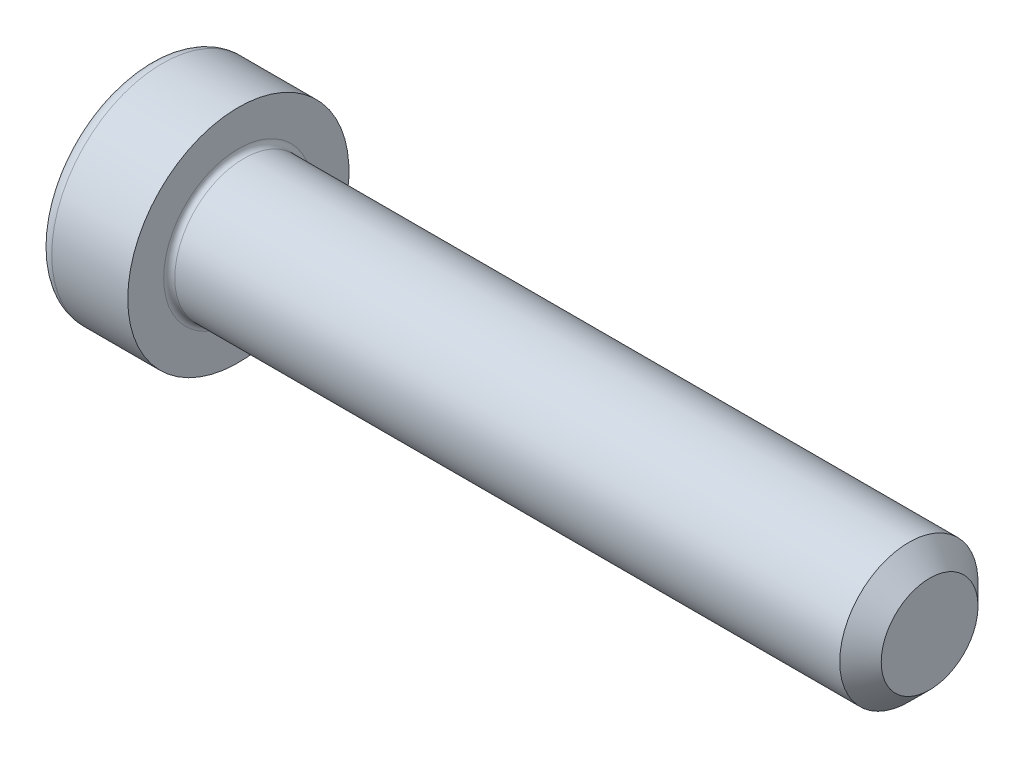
ISO-10303-21;
HEADER;
FILE_DESCRIPTION(('STEP AP214'),'2;1');
FILE_NAME('part.step','',(''),(''),'','','');
FILE_SCHEMA(('AUTOMOTIVE_DESIGN { 1 0 10303 214 1 1 1 1 }'));
ENDSEC;
DATA;
#1=APPLICATION_CONTEXT('core data for automotive mechanical design processes');
#2=APPLICATION_PROTOCOL_DEFINITION('international standard','automotive_design',2000,#1);
#3=PRODUCT_CONTEXT('',#1,'mechanical');
#4=PRODUCT('Part','Part','',(#3));
#5=PRODUCT_RELATED_PRODUCT_CATEGORY('part','',(#4));
#6=PRODUCT_DEFINITION_FORMATION('','',#4);
#7=PRODUCT_DEFINITION_CONTEXT('part definition',#1,'design');
#8=PRODUCT_DEFINITION('design','',#6,#7);
#9=PRODUCT_DEFINITION_SHAPE('','',#8);
#10=(LENGTH_UNIT() NAMED_UNIT(*) SI_UNIT(.MILLI.,.METRE.));
#11=(NAMED_UNIT(*) PLANE_ANGLE_UNIT() SI_UNIT($,.RADIAN.));
#12=(NAMED_UNIT(*) SI_UNIT($,.STERADIAN.) SOLID_ANGLE_UNIT());
#13=UNCERTAINTY_MEASURE_WITH_UNIT(LENGTH_MEASURE(1.E-05),#10,'distance_accuracy_value','');
#14=(GEOMETRIC_REPRESENTATION_CONTEXT(3) GLOBAL_UNCERTAINTY_ASSIGNED_CONTEXT((#13)) GLOBAL_UNIT_ASSIGNED_CONTEXT((#10,
#11,#12)) REPRESENTATION_CONTEXT('',''));
#15=CARTESIAN_POINT('',(0.,0.,0.));
#16=DIRECTION('',(0.,0.,1.));
#17=DIRECTION('',(1.,0.,0.));
#18=AXIS2_PLACEMENT_3D('',#15,#16,#17);
#19=CARTESIAN_POINT('',(-56.5,7.00000000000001,0.));
#20=DIRECTION('',(1.,0.,0.));
#21=DIRECTION('',(0.,0.,-1.));
#22=AXIS2_PLACEMENT_3D('',#19,#20,#21);
#23=PLANE('',#22);
#24=DIRECTION('',(0.,-0.5,-0.866025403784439));
#25=VECTOR('',#24,1.);
#26=CARTESIAN_POINT('',(-56.5,4.61880215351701,0.));
#27=LINE('',#26,#25);
#28=CARTESIAN_POINT('',(-56.5,4.61880215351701,0.));
#29=VERTEX_POINT('',#28);
#30=CARTESIAN_POINT('',(-56.5,2.3094010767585,-4.));
#31=VERTEX_POINT('',#30);
#32=EDGE_CURVE('E373',#29,#31,#27,.T.);
#33=ORIENTED_EDGE('',*,*,#32,.F.);
#34=DIRECTION('',(0.,0.5,-0.866025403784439));
#35=VECTOR('',#34,1.);
#36=CARTESIAN_POINT('',(-56.5,2.30940107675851,4.));
#37=LINE('',#36,#35);
#38=CARTESIAN_POINT('',(-56.5,2.30940107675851,4.));
#39=VERTEX_POINT('',#38);
#40=EDGE_CURVE('E449',#39,#29,#37,.T.);
#41=ORIENTED_EDGE('',*,*,#40,.F.);
#42=DIRECTION('',(0.,1.,0.));
#43=VECTOR('',#42,1.);
#44=CARTESIAN_POINT('',(-56.5,-2.30940107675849,4.));
#45=LINE('',#44,#43);
#46=CARTESIAN_POINT('',(-56.5,-2.30940107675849,4.));
#47=VERTEX_POINT('',#46);
#48=EDGE_CURVE('E720',#47,#39,#45,.T.);
#49=ORIENTED_EDGE('',*,*,#48,.F.);
#50=DIRECTION('',(0.,0.5,0.866025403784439));
#51=VECTOR('',#50,1.);
#52=CARTESIAN_POINT('',(-56.5,-4.618802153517,0.));
#53=LINE('',#52,#51);
#54=CARTESIAN_POINT('',(-56.5,-4.618802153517,0.));
#55=VERTEX_POINT('',#54);
#56=EDGE_CURVE('E716',#55,#47,#53,.T.);
#57=ORIENTED_EDGE('',*,*,#56,.F.);
#58=DIRECTION('',(0.,-0.5,0.866025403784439));
#59=VECTOR('',#58,1.);
#60=CARTESIAN_POINT('',(-56.5,-2.3094010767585,-4.));
#61=LINE('',#60,#59);
#62=CARTESIAN_POINT('',(-56.5,-2.3094010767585,-4.));
#63=VERTEX_POINT('',#62);
#64=EDGE_CURVE('E433',#63,#55,#61,.T.);
#65=ORIENTED_EDGE('',*,*,#64,.F.);
#66=DIRECTION('',(0.,-1.,0.));
#67=VECTOR('',#66,1.);
#68=CARTESIAN_POINT('',(-56.5,2.3094010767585,-4.));
#69=LINE('',#68,#67);
#70=EDGE_CURVE('E430',#31,#63,#69,.T.);
#71=ORIENTED_EDGE('',*,*,#70,.F.);
#72=EDGE_LOOP('',(#33,#41,#49,#57,#65,#71));
#73=FACE_BOUND('',#72,.T.);
#74=CARTESIAN_POINT('',(-56.5,0.,0.));
#75=DIRECTION('',(-1.,0.,0.));
#76=DIRECTION('',(0.,0.,1.));
#77=AXIS2_PLACEMENT_3D('',#74,#75,#76);
#78=CIRCLE('',#77,7.00000000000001);
#79=CARTESIAN_POINT('',(-56.5,0.,7.00000000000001));
#80=VERTEX_POINT('',#79);
#81=EDGE_CURVE('E11',#80,#80,#78,.T.);
#82=ORIENTED_EDGE('',*,*,#81,.T.);
#83=EDGE_LOOP('',(#82));
#84=FACE_BOUND('',#83,.T.);
#85=ADVANCED_FACE('F358',(#73,#84),#23,.F.);
#86=CARTESIAN_POINT('',(-55.5,0.,0.));
#87=DIRECTION('',(-1.,0.,0.));
#88=DIRECTION('',(0.,0.,1.));
#89=AXIS2_PLACEMENT_3D('',#86,#87,#88);
#90=TOROIDAL_SURFACE('',#89,7.00000000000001,1.);
#91=ORIENTED_EDGE('',*,*,#81,.F.);
#92=EDGE_LOOP('',(#91));
#93=FACE_BOUND('',#92,.T.);
#94=CARTESIAN_POINT('',(-55.5,0.,0.));
#95=DIRECTION('',(-1.,0.,0.));
#96=DIRECTION('',(0.,0.,1.));
#97=AXIS2_PLACEMENT_3D('',#94,#95,#96);
#98=CIRCLE('',#97,8.00000000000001);
#99=CARTESIAN_POINT('',(-55.5,0.,8.00000000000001));
#100=VERTEX_POINT('',#99);
#101=EDGE_CURVE('E366',#100,#100,#98,.T.);
#102=ORIENTED_EDGE('',*,*,#101,.T.);
#103=EDGE_LOOP('',(#102));
#104=FACE_BOUND('',#103,.T.);
#105=ADVANCED_FACE('F490',(#93,#104),#90,.T.);
#106=CARTESIAN_POINT('',(-89.316393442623,0.,0.));
#107=DIRECTION('',(-1.,0.,0.));
#108=DIRECTION('',(0.,0.,1.));
#109=AXIS2_PLACEMENT_3D('',#106,#107,#108);
#110=CYLINDRICAL_SURFACE('',#109,8.00000000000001);
#111=ORIENTED_EDGE('',*,*,#101,.F.);
#112=EDGE_LOOP('',(#111));
#113=FACE_BOUND('',#112,.T.);
#114=CARTESIAN_POINT('',(-50.,0.,0.));
#115=DIRECTION('',(-1.,0.,0.));
#116=DIRECTION('',(0.,0.,1.));
#117=AXIS2_PLACEMENT_3D('',#114,#115,#116);
#118=CIRCLE('',#117,8.00000000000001);
#119=CARTESIAN_POINT('',(-50.,0.,8.00000000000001));
#120=VERTEX_POINT('',#119);
#121=EDGE_CURVE('E484',#120,#120,#118,.T.);
#122=ORIENTED_EDGE('',*,*,#121,.T.);
#123=EDGE_LOOP('',(#122));
#124=FACE_BOUND('',#123,.T.);
#125=ADVANCED_FACE('F492',(#113,#124),#110,.T.);
#126=CARTESIAN_POINT('',(-50.,5.4,0.));
#127=DIRECTION('',(-1.,0.,0.));
#128=DIRECTION('',(0.,0.,1.));
#129=AXIS2_PLACEMENT_3D('',#126,#127,#128);
#130=PLANE('',#129);
#131=ORIENTED_EDGE('',*,*,#121,.F.);
#132=EDGE_LOOP('',(#131));
#133=FACE_BOUND('',#132,.T.);
#134=CARTESIAN_POINT('',(-50.,0.,0.));
#135=DIRECTION('',(-1.,0.,0.));
#136=DIRECTION('',(0.,0.,1.));
#137=AXIS2_PLACEMENT_3D('',#134,#135,#136);
#138=CIRCLE('',#137,5.4);
#139=CARTESIAN_POINT('',(-50.,0.,5.4));
#140=VERTEX_POINT('',#139);
#141=EDGE_CURVE('E481',#140,#140,#138,.T.);
#142=ORIENTED_EDGE('',*,*,#141,.T.);
#143=EDGE_LOOP('',(#142));
#144=FACE_BOUND('',#143,.T.);
#145=ADVANCED_FACE('F495',(#133,#144),#130,.F.);
#146=CARTESIAN_POINT('',(-49.6,0.,0.));
#147=DIRECTION('',(-1.,0.,0.));
#148=DIRECTION('',(0.,0.,1.));
#149=AXIS2_PLACEMENT_3D('',#146,#147,#148);
#150=TOROIDAL_SURFACE('',#149,5.4,0.399999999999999);
#151=ORIENTED_EDGE('',*,*,#141,.F.);
#152=EDGE_LOOP('',(#151));
#153=FACE_BOUND('',#152,.T.);
#154=CARTESIAN_POINT('',(-49.6,0.,0.));
#155=DIRECTION('',(-1.,0.,0.));
#156=DIRECTION('',(0.,0.,1.));
#157=AXIS2_PLACEMENT_3D('',#154,#155,#156);
#158=CIRCLE('',#157,5.);
#159=CARTESIAN_POINT('',(-49.6,0.,5.));
#160=VERTEX_POINT('',#159);
#161=EDGE_CURVE('E478',#160,#160,#158,.T.);
#162=ORIENTED_EDGE('',*,*,#161,.T.);
#163=EDGE_LOOP('',(#162));
#164=FACE_BOUND('',#163,.T.);
#165=ADVANCED_FACE('F501',(#153,#164),#150,.F.);
#166=CARTESIAN_POINT('',(-89.316393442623,0.,0.));
#167=DIRECTION('',(-1.,0.,0.));
#168=DIRECTION('',(0.,0.,1.));
#169=AXIS2_PLACEMENT_3D('',#166,#167,#168);
#170=CYLINDRICAL_SURFACE('',#169,5.);
#171=ORIENTED_EDGE('',*,*,#161,.F.);
#172=EDGE_LOOP('',(#171));
#173=FACE_BOUND('',#172,.T.);
#174=CARTESIAN_POINT('',(-1.50000000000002,0.,0.));
#175=DIRECTION('',(-1.,0.,0.));
#176=DIRECTION('',(0.,0.,1.));
#177=AXIS2_PLACEMENT_3D('',#174,#175,#176);
#178=CIRCLE('',#177,5.00000000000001);
#179=CARTESIAN_POINT('',(-1.50000000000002,0.,5.00000000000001));
#180=VERTEX_POINT('',#179);
#181=EDGE_CURVE('E475',#180,#180,#178,.T.);
#182=ORIENTED_EDGE('',*,*,#181,.T.);
#183=EDGE_LOOP('',(#182));
#184=FACE_BOUND('',#183,.T.);
#185=ADVANCED_FACE('F507',(#173,#184),#170,.T.);
#186=CARTESIAN_POINT('',(0.,0.,0.));
#187=DIRECTION('',(-1.,0.,0.));
#188=DIRECTION('',(0.,0.,1.));
#189=AXIS2_PLACEMENT_3D('',#186,#187,#188);
#190=CONICAL_SURFACE('',#189,3.5,0.785398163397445);
#191=ORIENTED_EDGE('',*,*,#181,.F.);
#192=EDGE_LOOP('',(#191));
#193=FACE_BOUND('',#192,.T.);
#194=CARTESIAN_POINT('',(0.,0.,0.));
#195=DIRECTION('',(-1.,0.,0.));
#196=DIRECTION('',(0.,0.,1.));
#197=AXIS2_PLACEMENT_3D('',#194,#195,#196);
#198=CIRCLE('',#197,3.5);
#199=CARTESIAN_POINT('',(0.,0.,3.5));
#200=VERTEX_POINT('',#199);
#201=EDGE_CURVE('E470',#200,#200,#198,.T.);
#202=ORIENTED_EDGE('',*,*,#201,.T.);
#203=EDGE_LOOP('',(#202));
#204=FACE_BOUND('',#203,.T.);
#205=ADVANCED_FACE('F513',(#193,#204),#190,.T.);
#206=CARTESIAN_POINT('',(0.,0.,0.));
#207=DIRECTION('',(-1.,0.,0.));
#208=DIRECTION('',(0.,0.,1.));
#209=AXIS2_PLACEMENT_3D('',#206,#207,#208);
#210=PLANE('',#209);
#211=ORIENTED_EDGE('',*,*,#201,.F.);
#212=EDGE_LOOP('',(#211));
#213=FACE_BOUND('',#212,.T.);
#214=ADVANCED_FACE('F519',(#213),#210,.F.);
#215=CARTESIAN_POINT('',(-53.,2.30940107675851,4.));
#216=DIRECTION('',(0.,0.866025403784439,0.5));
#217=DIRECTION('',(0.,-0.5,0.866025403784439));
#218=AXIS2_PLACEMENT_3D('',#215,#216,#217);
#219=PLANE('',#218);
#220=ORIENTED_EDGE('',*,*,#40,.T.);
#221=DIRECTION('',(-1.,0.,0.));
#222=VECTOR('',#221,1.);
#223=CARTESIAN_POINT('',(-53.,4.61880215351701,0.));
#224=LINE('',#223,#222);
#225=CARTESIAN_POINT('',(-53.,4.61880215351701,0.));
#226=VERTEX_POINT('',#225);
#227=EDGE_CURVE('E447',#226,#29,#224,.T.);
#228=ORIENTED_EDGE('',*,*,#227,.F.);
#229=DIRECTION('',(0.,0.5,-0.866025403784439));
#230=VECTOR('',#229,1.);
#231=CARTESIAN_POINT('',(-53.,2.30940107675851,4.));
#232=LINE('',#231,#230);
#233=CARTESIAN_POINT('',(-53.,3.46410161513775,1.99999999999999));
#234=VERTEX_POINT('',#233);
#235=EDGE_CURVE('E696',#234,#226,#232,.T.);
#236=ORIENTED_EDGE('',*,*,#235,.F.);
#237=CARTESIAN_POINT('',(-53.,2.30940107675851,4.));
#238=VERTEX_POINT('',#237);
#239=EDGE_CURVE('E381',#238,#234,#232,.T.);
#240=ORIENTED_EDGE('',*,*,#239,.F.);
#241=DIRECTION('',(-1.,0.,0.));
#242=VECTOR('',#241,1.);
#243=CARTESIAN_POINT('',(-53.,2.30940107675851,4.));
#244=LINE('',#243,#242);
#245=EDGE_CURVE('E466',#238,#39,#244,.T.);
#246=ORIENTED_EDGE('',*,*,#245,.T.);
#247=EDGE_LOOP('',(#220,#228,#236,#240,#246));
#248=FACE_BOUND('',#247,.T.);
#249=ADVANCED_FACE('F524',(#248),#219,.F.);
#250=CARTESIAN_POINT('',(-53.,-2.30940107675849,4.));
#251=DIRECTION('',(0.,0.,1.));
#252=DIRECTION('',(1.,0.,0.));
#253=AXIS2_PLACEMENT_3D('',#250,#251,#252);
#254=PLANE('',#253);
#255=ORIENTED_EDGE('',*,*,#48,.T.);
#256=ORIENTED_EDGE('',*,*,#245,.F.);
#257=DIRECTION('',(0.,1.,0.));
#258=VECTOR('',#257,1.);
#259=CARTESIAN_POINT('',(-53.,-2.30940107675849,4.));
#260=LINE('',#259,#258);
#261=CARTESIAN_POINT('',(-53.,0.,4.));
#262=VERTEX_POINT('',#261);
#263=EDGE_CURVE('E670',#262,#238,#260,.T.);
#264=ORIENTED_EDGE('',*,*,#263,.F.);
#265=CARTESIAN_POINT('',(-53.,-2.30940107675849,4.));
#266=VERTEX_POINT('',#265);
#267=EDGE_CURVE('E459',#266,#262,#260,.T.);
#268=ORIENTED_EDGE('',*,*,#267,.F.);
#269=DIRECTION('',(-1.,0.,0.));
#270=VECTOR('',#269,1.);
#271=CARTESIAN_POINT('',(-53.,-2.30940107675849,4.));
#272=LINE('',#271,#270);
#273=EDGE_CURVE('E712',#266,#47,#272,.T.);
#274=ORIENTED_EDGE('',*,*,#273,.T.);
#275=EDGE_LOOP('',(#255,#256,#264,#268,#274));
#276=FACE_BOUND('',#275,.T.);
#277=ADVANCED_FACE('F530',(#276),#254,.F.);
#278=CARTESIAN_POINT('',(-53.,-4.618802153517,0.));
#279=DIRECTION('',(0.,-0.866025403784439,0.5));
#280=DIRECTION('',(0.,-0.5,-0.866025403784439));
#281=AXIS2_PLACEMENT_3D('',#278,#279,#280);
#282=PLANE('',#281);
#283=ORIENTED_EDGE('',*,*,#56,.T.);
#284=ORIENTED_EDGE('',*,*,#273,.F.);
#285=DIRECTION('',(0.,0.5,0.866025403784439));
#286=VECTOR('',#285,1.);
#287=CARTESIAN_POINT('',(-53.,-4.618802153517,0.));
#288=LINE('',#287,#286);
#289=CARTESIAN_POINT('',(-53.,-3.46410161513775,1.99999999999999));
#290=VERTEX_POINT('',#289);
#291=EDGE_CURVE('E683',#290,#266,#288,.T.);
#292=ORIENTED_EDGE('',*,*,#291,.F.);
#293=CARTESIAN_POINT('',(-53.,-4.618802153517,0.));
#294=VERTEX_POINT('',#293);
#295=EDGE_CURVE('E680',#294,#290,#288,.T.);
#296=ORIENTED_EDGE('',*,*,#295,.F.);
#297=DIRECTION('',(-1.,0.,0.));
#298=VECTOR('',#297,1.);
#299=CARTESIAN_POINT('',(-53.,-4.618802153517,0.));
#300=LINE('',#299,#298);
#301=EDGE_CURVE('E457',#294,#55,#300,.T.);
#302=ORIENTED_EDGE('',*,*,#301,.T.);
#303=EDGE_LOOP('',(#283,#284,#292,#296,#302));
#304=FACE_BOUND('',#303,.T.);
#305=ADVANCED_FACE('F599',(#304),#282,.F.);
#306=CARTESIAN_POINT('',(-53.,-2.3094010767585,-4.));
#307=DIRECTION('',(0.,-0.866025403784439,-0.5));
#308=DIRECTION('',(0.,0.5,-0.866025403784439));
#309=AXIS2_PLACEMENT_3D('',#306,#307,#308);
#310=PLANE('',#309);
#311=ORIENTED_EDGE('',*,*,#64,.T.);
#312=ORIENTED_EDGE('',*,*,#301,.F.);
#313=DIRECTION('',(0.,-0.5,0.866025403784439));
#314=VECTOR('',#313,1.);
#315=CARTESIAN_POINT('',(-53.,-2.3094010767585,-4.));
#316=LINE('',#315,#314);
#317=CARTESIAN_POINT('',(-53.,-3.46410161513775,-2.));
#318=VERTEX_POINT('',#317);
#319=EDGE_CURVE('E705',#318,#294,#316,.T.);
#320=ORIENTED_EDGE('',*,*,#319,.F.);
#321=CARTESIAN_POINT('',(-53.,-2.3094010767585,-4.));
#322=VERTEX_POINT('',#321);
#323=EDGE_CURVE('E706',#322,#318,#316,.T.);
#324=ORIENTED_EDGE('',*,*,#323,.F.);
#325=DIRECTION('',(-1.,0.,0.));
#326=VECTOR('',#325,1.);
#327=CARTESIAN_POINT('',(-53.,-2.3094010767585,-4.));
#328=LINE('',#327,#326);
#329=EDGE_CURVE('E455',#322,#63,#328,.T.);
#330=ORIENTED_EDGE('',*,*,#329,.T.);
#331=EDGE_LOOP('',(#311,#312,#320,#324,#330));
#332=FACE_BOUND('',#331,.T.);
#333=ADVANCED_FACE('F607',(#332),#310,.F.);
#334=CARTESIAN_POINT('',(-53.,2.3094010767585,-4.));
#335=DIRECTION('',(0.,0.,-1.));
#336=DIRECTION('',(-1.,0.,0.));
#337=AXIS2_PLACEMENT_3D('',#334,#335,#336);
#338=PLANE('',#337);
#339=ORIENTED_EDGE('',*,*,#70,.T.);
#340=ORIENTED_EDGE('',*,*,#329,.F.);
#341=DIRECTION('',(0.,-1.,0.));
#342=VECTOR('',#341,1.);
#343=CARTESIAN_POINT('',(-53.,2.3094010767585,-4.));
#344=LINE('',#343,#342);
#345=CARTESIAN_POINT('',(-53.,0.,-4.));
#346=VERTEX_POINT('',#345);
#347=EDGE_CURVE('E698',#346,#322,#344,.T.);
#348=ORIENTED_EDGE('',*,*,#347,.F.);
#349=CARTESIAN_POINT('',(-53.,2.3094010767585,-4.));
#350=VERTEX_POINT('',#349);
#351=EDGE_CURVE('E454',#350,#346,#344,.T.);
#352=ORIENTED_EDGE('',*,*,#351,.F.);
#353=DIRECTION('',(-1.,0.,0.));
#354=VECTOR('',#353,1.);
#355=CARTESIAN_POINT('',(-53.,2.3094010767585,-4.));
#356=LINE('',#355,#354);
#357=EDGE_CURVE('E443',#350,#31,#356,.T.);
#358=ORIENTED_EDGE('',*,*,#357,.T.);
#359=EDGE_LOOP('',(#339,#340,#348,#352,#358));
#360=FACE_BOUND('',#359,.T.);
#361=ADVANCED_FACE('F451',(#360),#338,.F.);
#362=CARTESIAN_POINT('',(-53.,4.61880215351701,0.));
#363=DIRECTION('',(0.,0.866025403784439,-0.5));
#364=DIRECTION('',(0.,0.5,0.866025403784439));
#365=AXIS2_PLACEMENT_3D('',#362,#363,#364);
#366=PLANE('',#365);
#367=ORIENTED_EDGE('',*,*,#32,.T.);
#368=ORIENTED_EDGE('',*,*,#357,.F.);
#369=DIRECTION('',(0.,-0.5,-0.866025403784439));
#370=VECTOR('',#369,1.);
#371=CARTESIAN_POINT('',(-53.,4.61880215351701,0.));
#372=LINE('',#371,#370);
#373=CARTESIAN_POINT('',(-53.,3.46410161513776,-2.));
#374=VERTEX_POINT('',#373);
#375=EDGE_CURVE('E699',#374,#350,#372,.T.);
#376=ORIENTED_EDGE('',*,*,#375,.F.);
#377=EDGE_CURVE('E697',#226,#374,#372,.T.);
#378=ORIENTED_EDGE('',*,*,#377,.F.);
#379=ORIENTED_EDGE('',*,*,#227,.T.);
#380=EDGE_LOOP('',(#367,#368,#376,#378,#379));
#381=FACE_BOUND('',#380,.T.);
#382=ADVANCED_FACE('F441',(#381),#366,.F.);
#383=CARTESIAN_POINT('',(-53.,6.92820323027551,-4.));
#384=DIRECTION('',(-1.,0.,0.));
#385=DIRECTION('',(0.,0.,1.));
#386=AXIS2_PLACEMENT_3D('',#383,#384,#385);
#387=PLANE('',#386);
#388=CARTESIAN_POINT('',(-53.,0.,0.));
#389=DIRECTION('',(-1.,0.,0.));
#390=DIRECTION('',(0.,0.,1.));
#391=AXIS2_PLACEMENT_3D('',#388,#389,#390);
#392=CIRCLE('',#391,3.99999999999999);
#393=EDGE_CURVE('E472',#290,#262,#392,.T.);
#394=ORIENTED_EDGE('',*,*,#393,.F.);
#395=ORIENTED_EDGE('',*,*,#291,.T.);
#396=ORIENTED_EDGE('',*,*,#267,.T.);
#397=EDGE_LOOP('',(#394,#395,#396));
#398=FACE_BOUND('',#397,.T.);
#399=ADVANCED_FACE('F628',(#398),#387,.T.);
#400=EDGE_CURVE('E687',#318,#290,#392,.T.);
#401=ORIENTED_EDGE('',*,*,#400,.F.);
#402=ORIENTED_EDGE('',*,*,#319,.T.);
#403=ORIENTED_EDGE('',*,*,#295,.T.);
#404=EDGE_LOOP('',(#401,#402,#403));
#405=FACE_BOUND('',#404,.T.);
#406=ADVANCED_FACE('F635',(#405),#387,.T.);
#407=EDGE_CURVE('E688',#346,#318,#392,.T.);
#408=ORIENTED_EDGE('',*,*,#407,.F.);
#409=ORIENTED_EDGE('',*,*,#347,.T.);
#410=ORIENTED_EDGE('',*,*,#323,.T.);
#411=EDGE_LOOP('',(#408,#409,#410));
#412=FACE_BOUND('',#411,.T.);
#413=ADVANCED_FACE('F643',(#412),#387,.T.);
#414=EDGE_CURVE('E692',#374,#346,#392,.T.);
#415=ORIENTED_EDGE('',*,*,#414,.F.);
#416=ORIENTED_EDGE('',*,*,#375,.T.);
#417=ORIENTED_EDGE('',*,*,#351,.T.);
#418=EDGE_LOOP('',(#415,#416,#417));
#419=FACE_BOUND('',#418,.T.);
#420=ADVANCED_FACE('F650',(#419),#387,.T.);
#421=EDGE_CURVE('E471',#234,#374,#392,.T.);
#422=ORIENTED_EDGE('',*,*,#421,.F.);
#423=ORIENTED_EDGE('',*,*,#235,.T.);
#424=ORIENTED_EDGE('',*,*,#377,.T.);
#425=EDGE_LOOP('',(#422,#423,#424));
#426=FACE_BOUND('',#425,.T.);
#427=ADVANCED_FACE('F657',(#426),#387,.T.);
#428=EDGE_CURVE('E467',#262,#234,#392,.T.);
#429=ORIENTED_EDGE('',*,*,#428,.F.);
#430=ORIENTED_EDGE('',*,*,#263,.T.);
#431=ORIENTED_EDGE('',*,*,#239,.T.);
#432=EDGE_LOOP('',(#429,#430,#431));
#433=FACE_BOUND('',#432,.T.);
#434=ADVANCED_FACE('F587',(#433),#387,.T.);
#435=CARTESIAN_POINT('',(-49.,0.,0.));
#436=DIRECTION('',(-1.,0.,0.));
#437=DIRECTION('',(0.,0.,1.));
#438=AXIS2_PLACEMENT_3D('',#435,#436,#437);
#439=CONICAL_SURFACE('',#438,2.5,1.02974425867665);
#440=CARTESIAN_POINT('',(-47.4978484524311,0.,0.));
#441=VERTEX_POINT('',#440);
#442=VERTEX_LOOP('',#441);
#443=FACE_BOUND('',#442,.T.);
#444=CARTESIAN_POINT('',(-49.,0.,0.));
#445=DIRECTION('',(-1.,0.,0.));
#446=DIRECTION('',(0.,0.,1.));
#447=AXIS2_PLACEMENT_3D('',#444,#445,#446);
#448=CIRCLE('',#447,2.5);
#449=CARTESIAN_POINT('',(-49.,0.,2.5));
#450=VERTEX_POINT('',#449);
#451=EDGE_CURVE('E463',#450,#450,#448,.T.);
#452=ORIENTED_EDGE('',*,*,#451,.T.);
#453=EDGE_LOOP('',(#452));
#454=FACE_BOUND('',#453,.T.);
#455=ADVANCED_FACE('F580',(#443,#454),#439,.F.);
#456=CARTESIAN_POINT('',(-56.5,0.,0.));
#457=DIRECTION('',(-1.,0.,0.));
#458=DIRECTION('',(0.,0.,1.));
#459=AXIS2_PLACEMENT_3D('',#456,#457,#458);
#460=CYLINDRICAL_SURFACE('',#459,2.5);
#461=ORIENTED_EDGE('',*,*,#451,.F.);
#462=EDGE_LOOP('',(#461));
#463=FACE_BOUND('',#462,.T.);
#464=CARTESIAN_POINT('',(-52.1339745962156,0.,0.));
#465=DIRECTION('',(-1.,0.,0.));
#466=DIRECTION('',(0.,0.,1.));
#467=AXIS2_PLACEMENT_3D('',#464,#465,#466);
#468=CIRCLE('',#467,2.5);
#469=CARTESIAN_POINT('',(-52.1339745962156,0.,2.5));
#470=VERTEX_POINT('',#469);
#471=EDGE_CURVE('E361',#470,#470,#468,.F.);
#472=ORIENTED_EDGE('',*,*,#471,.F.);
#473=EDGE_LOOP('',(#472));
#474=FACE_BOUND('',#473,.T.);
#475=ADVANCED_FACE('F573',(#463,#474),#460,.F.);
#476=CARTESIAN_POINT('',(-53.,0.,0.));
#477=DIRECTION('',(-1.,0.,0.));
#478=DIRECTION('',(0.,0.,1.));
#479=AXIS2_PLACEMENT_3D('',#476,#477,#478);
#480=CONICAL_SURFACE('',#479,3.99999999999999,1.0471975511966);
#481=ORIENTED_EDGE('',*,*,#471,.T.);
#482=EDGE_LOOP('',(#481));
#483=FACE_BOUND('',#482,.T.);
#484=ORIENTED_EDGE('',*,*,#428,.T.);
#485=ORIENTED_EDGE('',*,*,#421,.T.);
#486=ORIENTED_EDGE('',*,*,#414,.T.);
#487=ORIENTED_EDGE('',*,*,#407,.T.);
#488=ORIENTED_EDGE('',*,*,#400,.T.);
#489=ORIENTED_EDGE('',*,*,#393,.T.);
#490=EDGE_LOOP('',(#484,#485,#486,#487,#488,#489));
#491=FACE_BOUND('',#490,.T.);
#492=ADVANCED_FACE('F568',(#483,#491),#480,.F.);
#493=CLOSED_SHELL('',(#85,#105,#125,#145,#165,#185,#205,#214,#249,#277,#305,#333,#361,#382,#399,
#406,#413,#420,#427,#434,#455,#475,#492));
#494=MANIFOLD_SOLID_BREP('B2',#493);
#495=ADVANCED_BREP_SHAPE_REPRESENTATION('',(#18,#494),#14);
#496=SHAPE_DEFINITION_REPRESENTATION(#9,#495);
ENDSEC;
END-ISO-10303-21;
